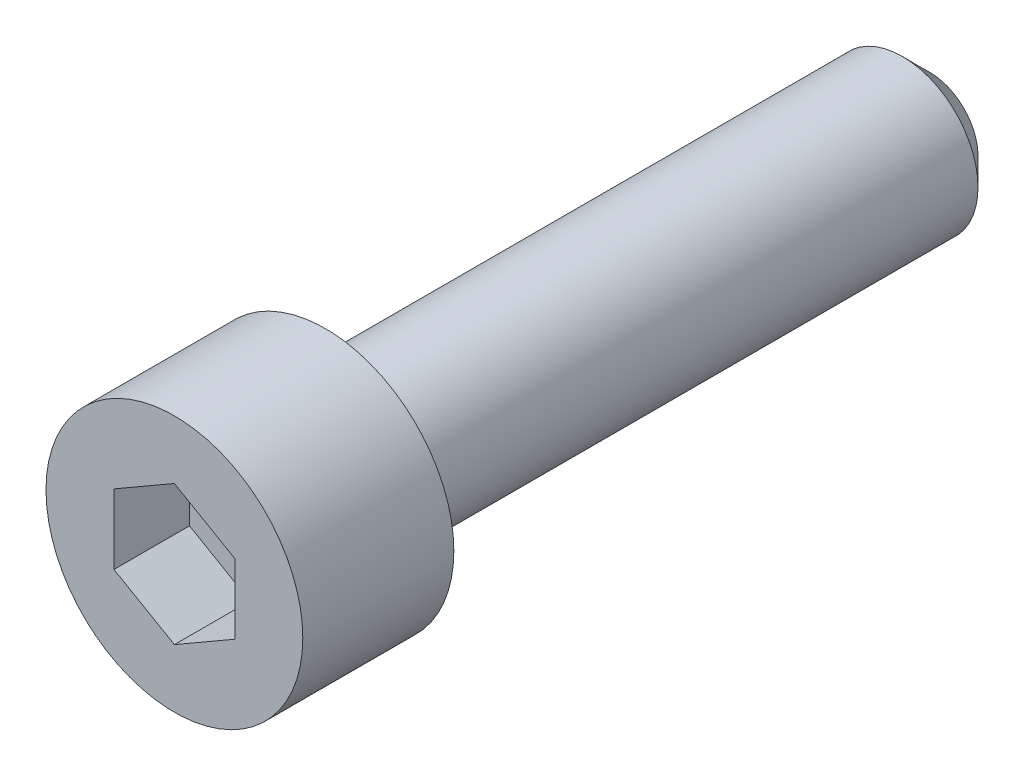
ISO-10303-21;
HEADER;
FILE_DESCRIPTION(('STEP AP214'),'2;1');
FILE_NAME('part.step','',(''),(''),'','','');
FILE_SCHEMA(('AUTOMOTIVE_DESIGN { 1 0 10303 214 1 1 1 1 }'));
ENDSEC;
DATA;
#1=APPLICATION_CONTEXT('core data for automotive mechanical design processes');
#2=APPLICATION_PROTOCOL_DEFINITION('international standard','automotive_design',2000,#1);
#3=PRODUCT_CONTEXT('',#1,'mechanical');
#4=PRODUCT('Part','Part','',(#3));
#5=PRODUCT_RELATED_PRODUCT_CATEGORY('part','',(#4));
#6=PRODUCT_DEFINITION_FORMATION('','',#4);
#7=PRODUCT_DEFINITION_CONTEXT('part definition',#1,'design');
#8=PRODUCT_DEFINITION('design','',#6,#7);
#9=PRODUCT_DEFINITION_SHAPE('','',#8);
#10=(LENGTH_UNIT() NAMED_UNIT(*) SI_UNIT(.MILLI.,.METRE.));
#11=(NAMED_UNIT(*) PLANE_ANGLE_UNIT() SI_UNIT($,.RADIAN.));
#12=(NAMED_UNIT(*) SI_UNIT($,.STERADIAN.) SOLID_ANGLE_UNIT());
#13=UNCERTAINTY_MEASURE_WITH_UNIT(LENGTH_MEASURE(1.E-05),#10,'distance_accuracy_value','');
#14=(GEOMETRIC_REPRESENTATION_CONTEXT(3) GLOBAL_UNCERTAINTY_ASSIGNED_CONTEXT((#13)) GLOBAL_UNIT_ASSIGNED_CONTEXT((#10,
#11,#12)) REPRESENTATION_CONTEXT('',''));
#15=CARTESIAN_POINT('',(0.,0.,0.));
#16=DIRECTION('',(0.,0.,1.));
#17=DIRECTION('',(1.,0.,0.));
#18=AXIS2_PLACEMENT_3D('',#15,#16,#17);
#19=CARTESIAN_POINT('',(0.,2.3094010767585,2.5));
#20=DIRECTION('',(-0.5,-0.86602540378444,0.));
#21=DIRECTION('',(0.86602540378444,-0.5,0.));
#22=AXIS2_PLACEMENT_3D('',#19,#20,#21);
#23=PLANE('',#22);
#24=DIRECTION('',(0.,0.,1.));
#25=VECTOR('',#24,1.);
#26=CARTESIAN_POINT('',(2.,1.15470053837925,2.5));
#27=LINE('',#26,#25);
#28=CARTESIAN_POINT('',(2.,1.15470053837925,2.5));
#29=VERTEX_POINT('',#28);
#30=CARTESIAN_POINT('',(2.,1.15470053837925,5.));
#31=VERTEX_POINT('',#30);
#32=EDGE_CURVE('E63',#29,#31,#27,.T.);
#33=ORIENTED_EDGE('',*,*,#32,.T.);
#34=DIRECTION('',(0.86602540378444,-0.5,0.));
#35=VECTOR('',#34,1.);
#36=CARTESIAN_POINT('',(0.,2.3094010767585,5.));
#37=LINE('',#36,#35);
#38=CARTESIAN_POINT('',(0.,2.3094010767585,5.));
#39=VERTEX_POINT('',#38);
#40=EDGE_CURVE('E29',#39,#31,#37,.T.);
#41=ORIENTED_EDGE('',*,*,#40,.F.);
#42=DIRECTION('',(0.,0.,1.));
#43=VECTOR('',#42,1.);
#44=CARTESIAN_POINT('',(0.,2.3094010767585,2.5));
#45=LINE('',#44,#43);
#46=CARTESIAN_POINT('',(0.,2.3094010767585,2.5));
#47=VERTEX_POINT('',#46);
#48=EDGE_CURVE('E33',#47,#39,#45,.T.);
#49=ORIENTED_EDGE('',*,*,#48,.F.);
#50=DIRECTION('',(0.86602540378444,-0.5,0.));
#51=VECTOR('',#50,1.);
#52=CARTESIAN_POINT('',(0.,2.3094010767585,2.5));
#53=LINE('',#52,#51);
#54=EDGE_CURVE('E65',#47,#29,#53,.T.);
#55=ORIENTED_EDGE('',*,*,#54,.T.);
#56=EDGE_LOOP('',(#33,#41,#49,#55));
#57=FACE_BOUND('',#56,.T.);
#58=ADVANCED_FACE('F14',(#57),#23,.T.);
#59=CARTESIAN_POINT('',(2.,-1.15470053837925,2.5));
#60=DIRECTION('',(1.,0.,0.));
#61=DIRECTION('',(0.,0.,-1.));
#62=AXIS2_PLACEMENT_3D('',#59,#60,#61);
#63=PLANE('',#62);
#64=DIRECTION('',(0.,0.,1.));
#65=VECTOR('',#64,1.);
#66=CARTESIAN_POINT('',(2.,-1.15470053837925,2.5));
#67=LINE('',#66,#65);
#68=CARTESIAN_POINT('',(2.,-1.15470053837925,2.5));
#69=VERTEX_POINT('',#68);
#70=CARTESIAN_POINT('',(2.,-1.15470053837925,5.));
#71=VERTEX_POINT('',#70);
#72=EDGE_CURVE('E70',#69,#71,#67,.T.);
#73=ORIENTED_EDGE('',*,*,#72,.T.);
#74=DIRECTION('',(0.,1.,0.));
#75=VECTOR('',#74,1.);
#76=CARTESIAN_POINT('',(2.,-1.15470053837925,5.));
#77=LINE('',#76,#75);
#78=EDGE_CURVE('E73',#71,#31,#77,.T.);
#79=ORIENTED_EDGE('',*,*,#78,.T.);
#80=ORIENTED_EDGE('',*,*,#32,.F.);
#81=DIRECTION('',(0.,1.,0.));
#82=VECTOR('',#81,1.);
#83=CARTESIAN_POINT('',(2.,-1.15470053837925,2.5));
#84=LINE('',#83,#82);
#85=EDGE_CURVE('E100',#69,#29,#84,.T.);
#86=ORIENTED_EDGE('',*,*,#85,.F.);
#87=EDGE_LOOP('',(#73,#79,#80,#86));
#88=FACE_BOUND('',#87,.T.);
#89=ADVANCED_FACE('F74',(#88),#63,.F.);
#90=CARTESIAN_POINT('',(0.,-2.3094010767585,2.5));
#91=DIRECTION('',(0.5,-0.86602540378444,0.));
#92=DIRECTION('',(0.86602540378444,0.5,0.));
#93=AXIS2_PLACEMENT_3D('',#90,#91,#92);
#94=PLANE('',#93);
#95=DIRECTION('',(0.,0.,1.));
#96=VECTOR('',#95,1.);
#97=CARTESIAN_POINT('',(0.,-2.3094010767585,2.5));
#98=LINE('',#97,#96);
#99=CARTESIAN_POINT('',(0.,-2.3094010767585,2.5));
#100=VERTEX_POINT('',#99);
#101=CARTESIAN_POINT('',(0.,-2.3094010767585,5.));
#102=VERTEX_POINT('',#101);
#103=EDGE_CURVE('E108',#100,#102,#98,.T.);
#104=ORIENTED_EDGE('',*,*,#103,.T.);
#105=DIRECTION('',(0.86602540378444,0.5,0.));
#106=VECTOR('',#105,1.);
#107=CARTESIAN_POINT('',(0.,-2.3094010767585,5.));
#108=LINE('',#107,#106);
#109=EDGE_CURVE('E78',#102,#71,#108,.T.);
#110=ORIENTED_EDGE('',*,*,#109,.T.);
#111=ORIENTED_EDGE('',*,*,#72,.F.);
#112=DIRECTION('',(0.86602540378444,0.5,0.));
#113=VECTOR('',#112,1.);
#114=CARTESIAN_POINT('',(0.,-2.3094010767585,2.5));
#115=LINE('',#114,#113);
#116=EDGE_CURVE('E97',#100,#69,#115,.T.);
#117=ORIENTED_EDGE('',*,*,#116,.F.);
#118=EDGE_LOOP('',(#104,#110,#111,#117));
#119=FACE_BOUND('',#118,.T.);
#120=ADVANCED_FACE('F139',(#119),#94,.F.);
#121=CARTESIAN_POINT('',(0.,-2.3094010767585,2.5));
#122=DIRECTION('',(0.5,0.86602540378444,0.));
#123=DIRECTION('',(-0.86602540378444,0.5,0.));
#124=AXIS2_PLACEMENT_3D('',#121,#122,#123);
#125=PLANE('',#124);
#126=DIRECTION('',(0.,0.,1.));
#127=VECTOR('',#126,1.);
#128=CARTESIAN_POINT('',(-2.,-1.15470053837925,2.5));
#129=LINE('',#128,#127);
#130=CARTESIAN_POINT('',(-2.,-1.15470053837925,2.5));
#131=VERTEX_POINT('',#130);
#132=CARTESIAN_POINT('',(-2.,-1.15470053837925,5.));
#133=VERTEX_POINT('',#132);
#134=EDGE_CURVE('E106',#131,#133,#129,.T.);
#135=ORIENTED_EDGE('',*,*,#134,.T.);
#136=DIRECTION('',(-0.86602540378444,0.5,0.));
#137=VECTOR('',#136,1.);
#138=CARTESIAN_POINT('',(0.,-2.3094010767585,5.));
#139=LINE('',#138,#137);
#140=EDGE_CURVE('E185',#102,#133,#139,.T.);
#141=ORIENTED_EDGE('',*,*,#140,.F.);
#142=ORIENTED_EDGE('',*,*,#103,.F.);
#143=DIRECTION('',(-0.86602540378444,0.5,0.));
#144=VECTOR('',#143,1.);
#145=CARTESIAN_POINT('',(0.,-2.3094010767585,2.5));
#146=LINE('',#145,#144);
#147=EDGE_CURVE('E94',#100,#131,#146,.T.);
#148=ORIENTED_EDGE('',*,*,#147,.T.);
#149=EDGE_LOOP('',(#135,#141,#142,#148));
#150=FACE_BOUND('',#149,.T.);
#151=ADVANCED_FACE('F151',(#150),#125,.T.);
#152=CARTESIAN_POINT('',(-2.,1.15470053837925,2.5));
#153=DIRECTION('',(-1.,0.,0.));
#154=DIRECTION('',(0.,-1.,0.));
#155=AXIS2_PLACEMENT_3D('',#152,#153,#154);
#156=PLANE('',#155);
#157=DIRECTION('',(0.,0.,1.));
#158=VECTOR('',#157,1.);
#159=CARTESIAN_POINT('',(-2.,1.15470053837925,2.5));
#160=LINE('',#159,#158);
#161=CARTESIAN_POINT('',(-2.,1.15470053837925,2.5));
#162=VERTEX_POINT('',#161);
#163=CARTESIAN_POINT('',(-2.,1.15470053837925,5.));
#164=VERTEX_POINT('',#163);
#165=EDGE_CURVE('E104',#162,#164,#160,.T.);
#166=ORIENTED_EDGE('',*,*,#165,.T.);
#167=DIRECTION('',(0.,-1.,0.));
#168=VECTOR('',#167,1.);
#169=CARTESIAN_POINT('',(-2.,1.15470053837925,5.));
#170=LINE('',#169,#168);
#171=EDGE_CURVE('E186',#164,#133,#170,.T.);
#172=ORIENTED_EDGE('',*,*,#171,.T.);
#173=ORIENTED_EDGE('',*,*,#134,.F.);
#174=DIRECTION('',(0.,-1.,0.));
#175=VECTOR('',#174,1.);
#176=CARTESIAN_POINT('',(-2.,1.15470053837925,2.5));
#177=LINE('',#176,#175);
#178=EDGE_CURVE('E91',#162,#131,#177,.T.);
#179=ORIENTED_EDGE('',*,*,#178,.F.);
#180=EDGE_LOOP('',(#166,#172,#173,#179));
#181=FACE_BOUND('',#180,.T.);
#182=ADVANCED_FACE('F147',(#181),#156,.F.);
#183=CARTESIAN_POINT('',(0.,2.3094010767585,2.5));
#184=DIRECTION('',(-0.5,0.86602540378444,0.));
#185=DIRECTION('',(-0.86602540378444,-0.5,0.));
#186=AXIS2_PLACEMENT_3D('',#183,#184,#185);
#187=PLANE('',#186);
#188=DIRECTION('',(-0.86602540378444,-0.5,0.));
#189=VECTOR('',#188,1.);
#190=CARTESIAN_POINT('',(0.,2.3094010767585,2.5));
#191=LINE('',#190,#189);
#192=EDGE_CURVE('E88',#47,#162,#191,.T.);
#193=ORIENTED_EDGE('',*,*,#192,.F.);
#194=ORIENTED_EDGE('',*,*,#48,.T.);
#195=DIRECTION('',(-0.86602540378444,-0.5,0.));
#196=VECTOR('',#195,1.);
#197=CARTESIAN_POINT('',(0.,2.3094010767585,5.));
#198=LINE('',#197,#196);
#199=EDGE_CURVE('E84',#39,#164,#198,.T.);
#200=ORIENTED_EDGE('',*,*,#199,.T.);
#201=ORIENTED_EDGE('',*,*,#165,.F.);
#202=EDGE_LOOP('',(#193,#194,#200,#201));
#203=FACE_BOUND('',#202,.T.);
#204=ADVANCED_FACE('F144',(#203),#187,.F.);
#205=CARTESIAN_POINT('',(-2.,3.46410161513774,2.5));
#206=DIRECTION('',(0.,0.,-1.));
#207=DIRECTION('',(-1.,0.,0.));
#208=AXIS2_PLACEMENT_3D('',#205,#206,#207);
#209=PLANE('',#208);
#210=ORIENTED_EDGE('',*,*,#54,.F.);
#211=ORIENTED_EDGE('',*,*,#192,.T.);
#212=ORIENTED_EDGE('',*,*,#178,.T.);
#213=ORIENTED_EDGE('',*,*,#147,.F.);
#214=ORIENTED_EDGE('',*,*,#116,.T.);
#215=ORIENTED_EDGE('',*,*,#85,.T.);
#216=EDGE_LOOP('',(#210,#211,#212,#213,#214,#215));
#217=FACE_BOUND('',#216,.T.);
#218=ADVANCED_FACE('F143',(#217),#209,.F.);
#219=CARTESIAN_POINT('',(0.,0.,5.));
#220=DIRECTION('',(0.,0.,1.));
#221=DIRECTION('',(1.,0.,0.));
#222=AXIS2_PLACEMENT_3D('',#219,#220,#221);
#223=PLANE('',#222);
#224=CARTESIAN_POINT('',(0.,0.,5.));
#225=DIRECTION('',(0.,0.,1.));
#226=DIRECTION('',(1.,0.,0.));
#227=AXIS2_PLACEMENT_3D('',#224,#225,#226);
#228=CIRCLE('',#227,4.25);
#229=CARTESIAN_POINT('',(4.25,0.,5.));
#230=VERTEX_POINT('',#229);
#231=EDGE_CURVE('E116',#230,#230,#228,.T.);
#232=ORIENTED_EDGE('',*,*,#231,.T.);
#233=EDGE_LOOP('',(#232));
#234=FACE_BOUND('',#233,.T.);
#235=ORIENTED_EDGE('',*,*,#199,.F.);
#236=ORIENTED_EDGE('',*,*,#40,.T.);
#237=ORIENTED_EDGE('',*,*,#78,.F.);
#238=ORIENTED_EDGE('',*,*,#109,.F.);
#239=ORIENTED_EDGE('',*,*,#140,.T.);
#240=ORIENTED_EDGE('',*,*,#171,.F.);
#241=EDGE_LOOP('',(#235,#236,#237,#238,#239,#240));
#242=FACE_BOUND('',#241,.T.);
#243=ADVANCED_FACE('F81',(#234,#242),#223,.T.);
#244=CARTESIAN_POINT('',(0.,0.,0.));
#245=DIRECTION('',(0.,0.,1.));
#246=DIRECTION('',(1.,0.,0.));
#247=AXIS2_PLACEMENT_3D('',#244,#245,#246);
#248=CYLINDRICAL_SURFACE('',#247,4.25);
#249=CARTESIAN_POINT('',(0.,0.,0.));
#250=DIRECTION('',(0.,0.,1.));
#251=DIRECTION('',(1.,0.,0.));
#252=AXIS2_PLACEMENT_3D('',#249,#250,#251);
#253=CIRCLE('',#252,4.25);
#254=CARTESIAN_POINT('',(4.25,0.,0.));
#255=VERTEX_POINT('',#254);
#256=EDGE_CURVE('E113',#255,#255,#253,.T.);
#257=ORIENTED_EDGE('',*,*,#256,.T.);
#258=EDGE_LOOP('',(#257));
#259=FACE_BOUND('',#258,.T.);
#260=ORIENTED_EDGE('',*,*,#231,.F.);
#261=EDGE_LOOP('',(#260));
#262=FACE_BOUND('',#261,.T.);
#263=ADVANCED_FACE('F164',(#259,#262),#248,.T.);
#264=CARTESIAN_POINT('',(4.25,0.,0.));
#265=DIRECTION('',(0.,0.,-1.));
#266=DIRECTION('',(-1.,0.,0.));
#267=AXIS2_PLACEMENT_3D('',#264,#265,#266);
#268=PLANE('',#267);
#269=CARTESIAN_POINT('',(0.,0.,0.));
#270=DIRECTION('',(0.,0.,1.));
#271=DIRECTION('',(1.,0.,0.));
#272=AXIS2_PLACEMENT_3D('',#269,#270,#271);
#273=CIRCLE('',#272,2.5);
#274=CARTESIAN_POINT('',(2.5,0.,0.));
#275=VERTEX_POINT('',#274);
#276=EDGE_CURVE('E69',#275,#275,#273,.T.);
#277=ORIENTED_EDGE('',*,*,#276,.T.);
#278=EDGE_LOOP('',(#277));
#279=FACE_BOUND('',#278,.T.);
#280=ORIENTED_EDGE('',*,*,#256,.F.);
#281=EDGE_LOOP('',(#280));
#282=FACE_BOUND('',#281,.T.);
#283=ADVANCED_FACE('F161',(#279,#282),#268,.T.);
#284=CARTESIAN_POINT('',(0.,0.,0.));
#285=DIRECTION('',(0.,0.,1.));
#286=DIRECTION('',(1.,0.,0.));
#287=AXIS2_PLACEMENT_3D('',#284,#285,#286);
#288=CYLINDRICAL_SURFACE('',#287,2.5);
#289=CARTESIAN_POINT('',(0.,0.,-19.1));
#290=DIRECTION('',(0.,0.,-1.));
#291=DIRECTION('',(-1.,0.,0.));
#292=AXIS2_PLACEMENT_3D('',#289,#290,#291);
#293=CIRCLE('',#292,2.5);
#294=CARTESIAN_POINT('',(-2.5,0.,-19.1));
#295=VERTEX_POINT('',#294);
#296=EDGE_CURVE('E22',#295,#295,#293,.F.);
#297=ORIENTED_EDGE('',*,*,#296,.T.);
#298=EDGE_LOOP('',(#297));
#299=FACE_BOUND('',#298,.T.);
#300=ORIENTED_EDGE('',*,*,#276,.F.);
#301=EDGE_LOOP('',(#300));
#302=FACE_BOUND('',#301,.T.);
#303=ADVANCED_FACE('F121',(#299,#302),#288,.T.);
#304=CARTESIAN_POINT('',(2.5,0.,-20.));
#305=DIRECTION('',(0.,0.,-1.));
#306=DIRECTION('',(-1.,0.,0.));
#307=AXIS2_PLACEMENT_3D('',#304,#305,#306);
#308=PLANE('',#307);
#309=CARTESIAN_POINT('',(0.,0.,-20.));
#310=DIRECTION('',(0.,0.,-1.));
#311=DIRECTION('',(-1.,0.,0.));
#312=AXIS2_PLACEMENT_3D('',#309,#310,#311);
#313=CIRCLE('',#312,1.6);
#314=CARTESIAN_POINT('',(-1.6,0.,-20.));
#315=VERTEX_POINT('',#314);
#316=EDGE_CURVE('E9',#315,#315,#313,.T.);
#317=ORIENTED_EDGE('',*,*,#316,.T.);
#318=EDGE_LOOP('',(#317));
#319=FACE_BOUND('',#318,.T.);
#320=ADVANCED_FACE('F125',(#319),#308,.T.);
#321=CARTESIAN_POINT('',(0.,0.,-19.1));
#322=DIRECTION('',(0.,0.,1.));
#323=DIRECTION('',(1.,0.,0.));
#324=AXIS2_PLACEMENT_3D('',#321,#322,#323);
#325=CONICAL_SURFACE('',#324,2.5,0.785398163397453);
#326=ORIENTED_EDGE('',*,*,#316,.F.);
#327=EDGE_LOOP('',(#326));
#328=FACE_BOUND('',#327,.T.);
#329=ORIENTED_EDGE('',*,*,#296,.F.);
#330=EDGE_LOOP('',(#329));
#331=FACE_BOUND('',#330,.T.);
#332=ADVANCED_FACE('F16',(#328,#331),#325,.T.);
#333=CLOSED_SHELL('',(#58,#89,#120,#151,#182,#204,#218,#243,#263,#283,#303,#320,#332));
#334=MANIFOLD_SOLID_BREP('B1',#333);
#335=ADVANCED_BREP_SHAPE_REPRESENTATION('',(#18,#334),#14);
#336=SHAPE_DEFINITION_REPRESENTATION(#9,#335);
ENDSEC;
END-ISO-10303-21;
